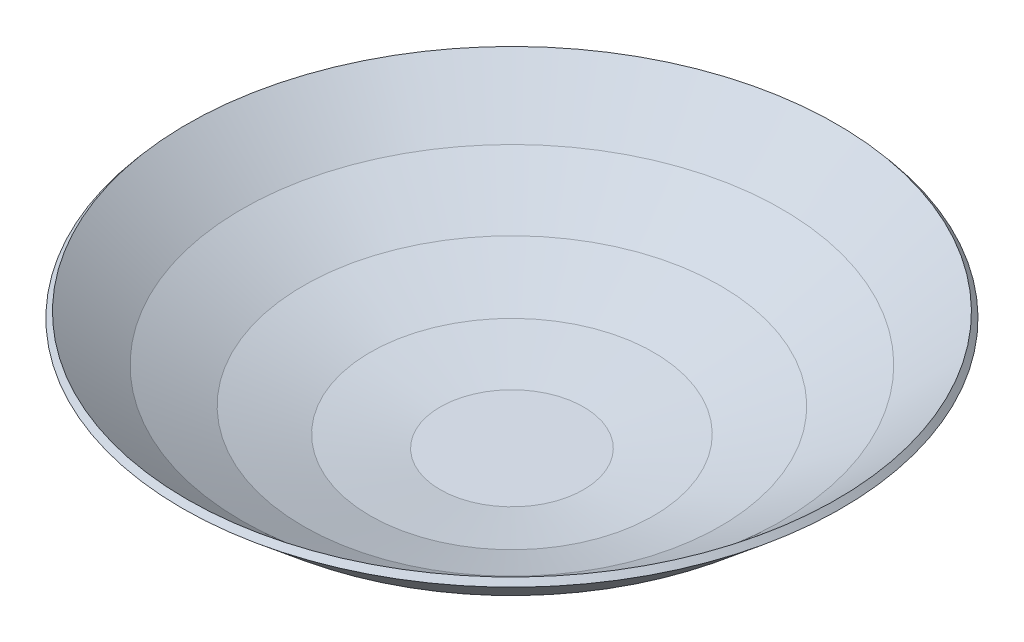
ISO-10303-21;
HEADER;
FILE_DESCRIPTION(('STEP AP214'),'2;1');
FILE_NAME('part.step','',(''),(''),'','','');
FILE_SCHEMA(('AUTOMOTIVE_DESIGN { 1 0 10303 214 1 1 1 1 }'));
ENDSEC;
DATA;
#1=APPLICATION_CONTEXT('core data for automotive mechanical design processes');
#2=APPLICATION_PROTOCOL_DEFINITION('international standard','automotive_design',2000,#1);
#3=PRODUCT_CONTEXT('',#1,'mechanical');
#4=PRODUCT('Part','Part','',(#3));
#5=PRODUCT_RELATED_PRODUCT_CATEGORY('part','',(#4));
#6=PRODUCT_DEFINITION_FORMATION('','',#4);
#7=PRODUCT_DEFINITION_CONTEXT('part definition',#1,'design');
#8=PRODUCT_DEFINITION('design','',#6,#7);
#9=PRODUCT_DEFINITION_SHAPE('','',#8);
#10=(LENGTH_UNIT() NAMED_UNIT(*) SI_UNIT(.MILLI.,.METRE.));
#11=(NAMED_UNIT(*) PLANE_ANGLE_UNIT() SI_UNIT($,.RADIAN.));
#12=(NAMED_UNIT(*) SI_UNIT($,.STERADIAN.) SOLID_ANGLE_UNIT());
#13=UNCERTAINTY_MEASURE_WITH_UNIT(LENGTH_MEASURE(1.E-05),#10,'distance_accuracy_value','');
#14=(GEOMETRIC_REPRESENTATION_CONTEXT(3) GLOBAL_UNCERTAINTY_ASSIGNED_CONTEXT((#13)) GLOBAL_UNIT_ASSIGNED_CONTEXT((#10,
#11,#12)) REPRESENTATION_CONTEXT('',''));
#15=CARTESIAN_POINT('',(0.,0.,0.));
#16=DIRECTION('',(0.,0.,1.));
#17=DIRECTION('',(1.,0.,0.));
#18=AXIS2_PLACEMENT_3D('',#15,#16,#17);
#19=CARTESIAN_POINT('',(23.9447106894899,0.,0.));
#20=DIRECTION('',(0.,1.,0.));
#21=DIRECTION('',(0.,0.,1.));
#22=AXIS2_PLACEMENT_3D('',#19,#20,#21);
#23=PLANE('',#22);
#24=CARTESIAN_POINT('',(0.,0.,0.));
#25=DIRECTION('',(0.,1.,0.));
#26=DIRECTION('',(0.,0.,1.));
#27=AXIS2_PLACEMENT_3D('',#24,#25,#26);
#28=CIRCLE('',#27,9.91251133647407);
#29=CARTESIAN_POINT('',(0.,0.,9.91251133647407));
#30=VERTEX_POINT('',#29);
#31=EDGE_CURVE('E10',#30,#30,#28,.T.);
#32=ORIENTED_EDGE('',*,*,#31,.F.);
#33=EDGE_LOOP('',(#32));
#34=FACE_BOUND('',#33,.T.);
#35=ADVANCED_FACE('F31',(#34),#23,.F.);
#36=CARTESIAN_POINT('',(0.,1.,0.));
#37=DIRECTION('',(0.,1.,0.));
#38=DIRECTION('',(0.,0.,1.));
#39=AXIS2_PLACEMENT_3D('',#36,#37,#38);
#40=TOROIDAL_SURFACE('',#39,9.91251133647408,1.);
#41=CARTESIAN_POINT('',(0.,0.0151922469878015,0.));
#42=DIRECTION('',(0.,1.,0.));
#43=DIRECTION('',(0.,0.,1.));
#44=AXIS2_PLACEMENT_3D('',#41,#42,#43);
#45=CIRCLE('',#44,10.086159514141);
#46=CARTESIAN_POINT('',(0.,0.0151922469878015,10.086159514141));
#47=VERTEX_POINT('',#46);
#48=EDGE_CURVE('E37',#47,#47,#45,.T.);
#49=ORIENTED_EDGE('',*,*,#48,.F.);
#50=EDGE_LOOP('',(#49));
#51=FACE_BOUND('',#50,.T.);
#52=ORIENTED_EDGE('',*,*,#31,.T.);
#53=EDGE_LOOP('',(#52));
#54=FACE_BOUND('',#53,.T.);
#55=ADVANCED_FACE('F97',(#51,#54),#40,.T.);
#56=CARTESIAN_POINT('',(0.,0.0151922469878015,0.));
#57=DIRECTION('',(0.,1.,0.));
#58=DIRECTION('',(0.,0.,1.));
#59=AXIS2_PLACEMENT_3D('',#56,#57,#58);
#60=CONICAL_SURFACE('',#59,10.086159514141,1.39626340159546);
#61=CARTESIAN_POINT('',(0.,1.72128952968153,0.));
#62=DIRECTION('',(0.,1.,0.));
#63=DIRECTION('',(0.,0.,1.));
#64=AXIS2_PLACEMENT_3D('',#61,#62,#63);
#65=CIRCLE('',#64,19.7619180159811);
#66=CARTESIAN_POINT('',(0.,1.72128952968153,19.7619180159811));
#67=VERTEX_POINT('',#66);
#68=EDGE_CURVE('E41',#67,#67,#65,.T.);
#69=ORIENTED_EDGE('',*,*,#68,.F.);
#70=EDGE_LOOP('',(#69));
#71=FACE_BOUND('',#70,.T.);
#72=ORIENTED_EDGE('',*,*,#48,.T.);
#73=EDGE_LOOP('',(#72));
#74=FACE_BOUND('',#73,.T.);
#75=ADVANCED_FACE('F102',(#71,#74),#60,.T.);
#76=CARTESIAN_POINT('',(0.,2.70609728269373,0.));
#77=DIRECTION('',(0.,1.,0.));
#78=DIRECTION('',(0.,0.,1.));
#79=AXIS2_PLACEMENT_3D('',#76,#77,#78);
#80=TOROIDAL_SURFACE('',#79,19.5882698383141,1.);
#81=CARTESIAN_POINT('',(0.,1.76640466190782,0.));
#82=DIRECTION('',(0.,1.,0.));
#83=DIRECTION('',(0.,0.,1.));
#84=AXIS2_PLACEMENT_3D('',#81,#82,#83);
#85=CIRCLE('',#84,19.9302899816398);
#86=CARTESIAN_POINT('',(0.,1.76640466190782,19.9302899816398));
#87=VERTEX_POINT('',#86);
#88=EDGE_CURVE('E45',#87,#87,#85,.T.);
#89=ORIENTED_EDGE('',*,*,#88,.F.);
#90=EDGE_LOOP('',(#89));
#91=FACE_BOUND('',#90,.T.);
#92=ORIENTED_EDGE('',*,*,#68,.T.);
#93=EDGE_LOOP('',(#92));
#94=FACE_BOUND('',#93,.T.);
#95=ADVANCED_FACE('F107',(#91,#94),#80,.T.);
#96=CARTESIAN_POINT('',(0.,1.76640466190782,0.));
#97=DIRECTION('',(0.,1.,0.));
#98=DIRECTION('',(0.,0.,1.));
#99=AXIS2_PLACEMENT_3D('',#96,#97,#98);
#100=CONICAL_SURFACE('',#99,19.9302899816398,1.22173047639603);
#101=CARTESIAN_POINT('',(0.,5.12676032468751,0.));
#102=DIRECTION('',(0.,1.,0.));
#103=DIRECTION('',(0.,0.,1.));
#104=AXIS2_PLACEMENT_3D('',#101,#102,#103);
#105=CIRCLE('',#104,29.1627912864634);
#106=CARTESIAN_POINT('',(0.,5.12676032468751,29.1627912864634));
#107=VERTEX_POINT('',#106);
#108=EDGE_CURVE('E50',#107,#107,#105,.T.);
#109=ORIENTED_EDGE('',*,*,#108,.F.);
#110=EDGE_LOOP('',(#109));
#111=FACE_BOUND('',#110,.T.);
#112=ORIENTED_EDGE('',*,*,#88,.T.);
#113=EDGE_LOOP('',(#112));
#114=FACE_BOUND('',#113,.T.);
#115=ADVANCED_FACE('F113',(#111,#114),#100,.T.);
#116=CARTESIAN_POINT('',(0.,6.06645294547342,0.));
#117=DIRECTION('',(0.,1.,0.));
#118=DIRECTION('',(0.,0.,1.));
#119=AXIS2_PLACEMENT_3D('',#116,#117,#118);
#120=TOROIDAL_SURFACE('',#119,28.8207711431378,0.999999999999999);
#121=CARTESIAN_POINT('',(0.,5.20042754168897,0.));
#122=DIRECTION('',(0.,1.,0.));
#123=DIRECTION('',(0.,0.,1.));
#124=AXIS2_PLACEMENT_3D('',#121,#122,#123);
#125=CIRCLE('',#124,29.3207711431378);
#126=CARTESIAN_POINT('',(0.,5.20042754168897,29.3207711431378));
#127=VERTEX_POINT('',#126);
#128=EDGE_CURVE('E53',#127,#127,#125,.T.);
#129=ORIENTED_EDGE('',*,*,#128,.F.);
#130=EDGE_LOOP('',(#129));
#131=FACE_BOUND('',#130,.T.);
#132=ORIENTED_EDGE('',*,*,#108,.T.);
#133=EDGE_LOOP('',(#132));
#134=FACE_BOUND('',#133,.T.);
#135=ADVANCED_FACE('F117',(#131,#134),#120,.T.);
#136=CARTESIAN_POINT('',(0.,5.20042754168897,0.));
#137=DIRECTION('',(0.,1.,0.));
#138=DIRECTION('',(0.,0.,1.));
#139=AXIS2_PLACEMENT_3D('',#136,#137,#138);
#140=CONICAL_SURFACE('',#139,29.3207711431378,1.0471975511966);
#141=CARTESIAN_POINT('',(0.,10.112938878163,0.));
#142=DIRECTION('',(0.,1.,0.));
#143=DIRECTION('',(0.,0.,1.));
#144=AXIS2_PLACEMENT_3D('',#141,#142,#143);
#145=CIRCLE('',#144,37.8294903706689);
#146=CARTESIAN_POINT('',(0.,10.112938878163,37.8294903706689));
#147=VERTEX_POINT('',#146);
#148=EDGE_CURVE('E56',#147,#147,#145,.T.);
#149=ORIENTED_EDGE('',*,*,#148,.F.);
#150=EDGE_LOOP('',(#149));
#151=FACE_BOUND('',#150,.T.);
#152=ORIENTED_EDGE('',*,*,#128,.T.);
#153=EDGE_LOOP('',(#152));
#154=FACE_BOUND('',#153,.T.);
#155=ADVANCED_FACE('F121',(#151,#154),#140,.T.);
#156=CARTESIAN_POINT('',(0.,10.9789642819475,0.));
#157=DIRECTION('',(0.,1.,0.));
#158=DIRECTION('',(0.,0.,1.));
#159=AXIS2_PLACEMENT_3D('',#156,#157,#158);
#160=TOROIDAL_SURFACE('',#159,37.3294903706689,1.00000000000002);
#161=CARTESIAN_POINT('',(0.,10.2129198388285,0.));
#162=DIRECTION('',(0.,1.,0.));
#163=DIRECTION('',(0.,0.,1.));
#164=AXIS2_PLACEMENT_3D('',#161,#162,#163);
#165=CIRCLE('',#164,37.9722779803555);
#166=CARTESIAN_POINT('',(0.,10.2129198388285,37.9722779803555));
#167=VERTEX_POINT('',#166);
#168=EDGE_CURVE('E59',#167,#167,#165,.T.);
#169=ORIENTED_EDGE('',*,*,#168,.F.);
#170=EDGE_LOOP('',(#169));
#171=FACE_BOUND('',#170,.T.);
#172=ORIENTED_EDGE('',*,*,#148,.T.);
#173=EDGE_LOOP('',(#172));
#174=FACE_BOUND('',#173,.T.);
#175=ADVANCED_FACE('F125',(#171,#174),#160,.T.);
#176=CARTESIAN_POINT('',(0.,10.2129198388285,0.));
#177=DIRECTION('',(0.,1.,0.));
#178=DIRECTION('',(0.,0.,1.));
#179=AXIS2_PLACEMENT_3D('',#176,#177,#178);
#180=CONICAL_SURFACE('',#179,37.9722779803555,0.872664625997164);
#181=CARTESIAN_POINT('',(0.,16.5845593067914,0.));
#182=DIRECTION('',(0.,1.,0.));
#183=DIRECTION('',(0.,0.,1.));
#184=AXIS2_PLACEMENT_3D('',#181,#182,#183);
#185=CIRCLE('',#184,45.5657022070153);
#186=CARTESIAN_POINT('',(0.,16.5845593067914,45.5657022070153));
#187=VERTEX_POINT('',#186);
#188=EDGE_CURVE('E62',#187,#187,#185,.T.);
#189=ORIENTED_EDGE('',*,*,#188,.F.);
#190=EDGE_LOOP('',(#189));
#191=FACE_BOUND('',#190,.T.);
#192=ORIENTED_EDGE('',*,*,#168,.T.);
#193=EDGE_LOOP('',(#192));
#194=FACE_BOUND('',#193,.T.);
#195=ADVANCED_FACE('F129',(#191,#194),#180,.T.);
#196=CARTESIAN_POINT('',(0.,17.3506037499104,0.));
#197=DIRECTION('',(0.,-1.,0.));
#198=DIRECTION('',(0.,0.,-1.));
#199=AXIS2_PLACEMENT_3D('',#196,#197,#198);
#200=CONICAL_SURFACE('',#199,44.9229145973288,0.69813170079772);
#201=ORIENTED_EDGE('',*,*,#188,.T.);
#202=EDGE_LOOP('',(#201));
#203=FACE_BOUND('',#202,.T.);
#204=CARTESIAN_POINT('',(0.,17.3506037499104,0.));
#205=DIRECTION('',(0.,1.,0.));
#206=DIRECTION('',(0.,0.,1.));
#207=AXIS2_PLACEMENT_3D('',#204,#205,#206);
#208=CIRCLE('',#207,44.9229145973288);
#209=CARTESIAN_POINT('',(0.,17.3506037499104,44.9229145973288));
#210=VERTEX_POINT('',#209);
#211=EDGE_CURVE('E65',#210,#210,#208,.T.);
#212=ORIENTED_EDGE('',*,*,#211,.F.);
#213=EDGE_LOOP('',(#212));
#214=FACE_BOUND('',#213,.T.);
#215=ADVANCED_FACE('F133',(#203,#214),#200,.T.);
#216=CARTESIAN_POINT('',(0.,10.9789642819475,0.));
#217=DIRECTION('',(0.,1.,0.));
#218=DIRECTION('',(0.,0.,1.));
#219=AXIS2_PLACEMENT_3D('',#216,#217,#218);
#220=CONICAL_SURFACE('',#219,37.3294903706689,0.872664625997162);
#221=ORIENTED_EDGE('',*,*,#211,.T.);
#222=EDGE_LOOP('',(#221));
#223=FACE_BOUND('',#222,.T.);
#224=CARTESIAN_POINT('',(0.,10.9789642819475,0.));
#225=DIRECTION('',(0.,1.,0.));
#226=DIRECTION('',(0.,0.,1.));
#227=AXIS2_PLACEMENT_3D('',#224,#225,#226);
#228=CIRCLE('',#227,37.3294903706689);
#229=CARTESIAN_POINT('',(0.,10.9789642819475,37.3294903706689));
#230=VERTEX_POINT('',#229);
#231=EDGE_CURVE('E68',#230,#230,#228,.T.);
#232=ORIENTED_EDGE('',*,*,#231,.F.);
#233=EDGE_LOOP('',(#232));
#234=FACE_BOUND('',#233,.T.);
#235=ADVANCED_FACE('F137',(#223,#234),#220,.F.);
#236=CARTESIAN_POINT('',(0.,6.06645294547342,0.));
#237=DIRECTION('',(0.,1.,0.));
#238=DIRECTION('',(0.,0.,1.));
#239=AXIS2_PLACEMENT_3D('',#236,#237,#238);
#240=CONICAL_SURFACE('',#239,28.8207711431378,1.0471975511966);
#241=ORIENTED_EDGE('',*,*,#231,.T.);
#242=EDGE_LOOP('',(#241));
#243=FACE_BOUND('',#242,.T.);
#244=CARTESIAN_POINT('',(0.,6.06645294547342,0.));
#245=DIRECTION('',(0.,1.,0.));
#246=DIRECTION('',(0.,0.,1.));
#247=AXIS2_PLACEMENT_3D('',#244,#245,#246);
#248=CIRCLE('',#247,28.8207711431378);
#249=CARTESIAN_POINT('',(0.,6.06645294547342,28.8207711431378));
#250=VERTEX_POINT('',#249);
#251=EDGE_CURVE('E71',#250,#250,#248,.T.);
#252=ORIENTED_EDGE('',*,*,#251,.F.);
#253=EDGE_LOOP('',(#252));
#254=FACE_BOUND('',#253,.T.);
#255=ADVANCED_FACE('F93',(#243,#254),#240,.F.);
#256=CARTESIAN_POINT('',(0.,2.70609728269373,0.));
#257=DIRECTION('',(0.,1.,0.));
#258=DIRECTION('',(0.,0.,1.));
#259=AXIS2_PLACEMENT_3D('',#256,#257,#258);
#260=CONICAL_SURFACE('',#259,19.5882698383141,1.22173047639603);
#261=ORIENTED_EDGE('',*,*,#251,.T.);
#262=EDGE_LOOP('',(#261));
#263=FACE_BOUND('',#262,.T.);
#264=CARTESIAN_POINT('',(0.,2.70609728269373,0.));
#265=DIRECTION('',(0.,1.,0.));
#266=DIRECTION('',(0.,0.,1.));
#267=AXIS2_PLACEMENT_3D('',#264,#265,#266);
#268=CIRCLE('',#267,19.5882698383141);
#269=CARTESIAN_POINT('',(0.,2.70609728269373,19.5882698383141));
#270=VERTEX_POINT('',#269);
#271=EDGE_CURVE('E74',#270,#270,#268,.T.);
#272=ORIENTED_EDGE('',*,*,#271,.F.);
#273=EDGE_LOOP('',(#272));
#274=FACE_BOUND('',#273,.T.);
#275=ADVANCED_FACE('F85',(#263,#274),#260,.F.);
#276=CARTESIAN_POINT('',(0.,1.,0.));
#277=DIRECTION('',(0.,1.,0.));
#278=DIRECTION('',(0.,0.,1.));
#279=AXIS2_PLACEMENT_3D('',#276,#277,#278);
#280=CONICAL_SURFACE('',#279,9.91251133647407,1.39626340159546);
#281=ORIENTED_EDGE('',*,*,#271,.T.);
#282=EDGE_LOOP('',(#281));
#283=FACE_BOUND('',#282,.T.);
#284=CARTESIAN_POINT('',(0.,1.,0.));
#285=DIRECTION('',(0.,1.,0.));
#286=DIRECTION('',(0.,0.,1.));
#287=AXIS2_PLACEMENT_3D('',#284,#285,#286);
#288=CIRCLE('',#287,9.91251133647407);
#289=CARTESIAN_POINT('',(0.,1.,9.91251133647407));
#290=VERTEX_POINT('',#289);
#291=EDGE_CURVE('E77',#290,#290,#288,.T.);
#292=ORIENTED_EDGE('',*,*,#291,.F.);
#293=EDGE_LOOP('',(#292));
#294=FACE_BOUND('',#293,.T.);
#295=ADVANCED_FACE('F83',(#283,#294),#280,.F.);
#296=CARTESIAN_POINT('',(23.9447106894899,1.,0.));
#297=DIRECTION('',(0.,1.,0.));
#298=DIRECTION('',(0.,0.,1.));
#299=AXIS2_PLACEMENT_3D('',#296,#297,#298);
#300=PLANE('',#299);
#301=ORIENTED_EDGE('',*,*,#291,.T.);
#302=EDGE_LOOP('',(#301));
#303=FACE_BOUND('',#302,.T.);
#304=ADVANCED_FACE('F81',(#303),#300,.T.);
#305=CLOSED_SHELL('',(#35,#55,#75,#95,#115,#135,#155,#175,#195,#215,#235,#255,#275,#295,#304));
#306=MANIFOLD_SOLID_BREP('B2',#305);
#307=ADVANCED_BREP_SHAPE_REPRESENTATION('',(#18,#306),#14);
#308=SHAPE_DEFINITION_REPRESENTATION(#9,#307);
ENDSEC;
END-ISO-10303-21;
